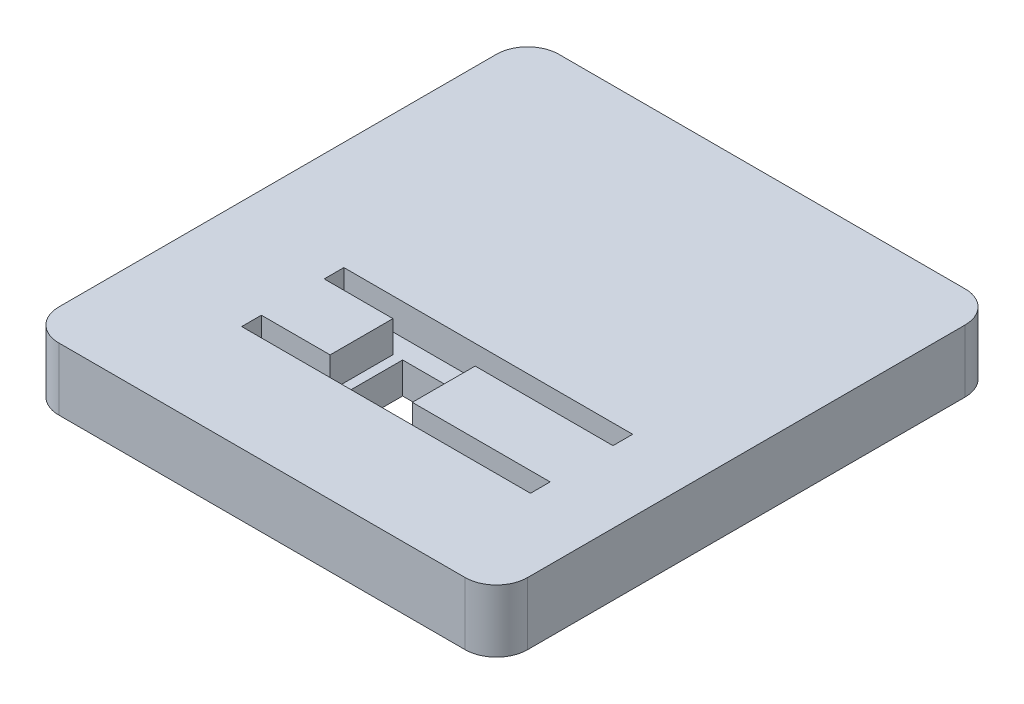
ISO-10303-21;
HEADER;
FILE_DESCRIPTION(('STEP AP214'),'2;1');
FILE_NAME('part.step','',(''),(''),'','','');
FILE_SCHEMA(('AUTOMOTIVE_DESIGN { 1 0 10303 214 1 1 1 1 }'));
ENDSEC;
DATA;
#1=APPLICATION_CONTEXT('core data for automotive mechanical design processes');
#2=APPLICATION_PROTOCOL_DEFINITION('international standard','automotive_design',2000,#1);
#3=PRODUCT_CONTEXT('',#1,'mechanical');
#4=PRODUCT('Part','Part','',(#3));
#5=PRODUCT_RELATED_PRODUCT_CATEGORY('part','',(#4));
#6=PRODUCT_DEFINITION_FORMATION('','',#4);
#7=PRODUCT_DEFINITION_CONTEXT('part definition',#1,'design');
#8=PRODUCT_DEFINITION('design','',#6,#7);
#9=PRODUCT_DEFINITION_SHAPE('','',#8);
#10=(LENGTH_UNIT() NAMED_UNIT(*) SI_UNIT(.MILLI.,.METRE.));
#11=(NAMED_UNIT(*) PLANE_ANGLE_UNIT() SI_UNIT($,.RADIAN.));
#12=(NAMED_UNIT(*) SI_UNIT($,.STERADIAN.) SOLID_ANGLE_UNIT());
#13=UNCERTAINTY_MEASURE_WITH_UNIT(LENGTH_MEASURE(1.E-05),#10,'distance_accuracy_value','');
#14=(GEOMETRIC_REPRESENTATION_CONTEXT(3) GLOBAL_UNCERTAINTY_ASSIGNED_CONTEXT((#13)) GLOBAL_UNIT_ASSIGNED_CONTEXT((#10,
#11,#12)) REPRESENTATION_CONTEXT('',''));
#15=CARTESIAN_POINT('',(0.,0.,0.));
#16=DIRECTION('',(0.,0.,1.));
#17=DIRECTION('',(1.,0.,0.));
#18=AXIS2_PLACEMENT_3D('',#15,#16,#17);
#19=CARTESIAN_POINT('',(2.5,-5.,-0.150000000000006));
#20=DIRECTION('',(1.,0.,0.));
#21=DIRECTION('',(0.,0.,-1.));
#22=AXIS2_PLACEMENT_3D('',#19,#20,#21);
#23=PLANE('',#22);
#24=DIRECTION('',(0.,0.,-1.));
#25=VECTOR('',#24,1.);
#26=CARTESIAN_POINT('',(2.5,5.,-0.150000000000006));
#27=LINE('',#26,#25);
#28=CARTESIAN_POINT('',(2.5,5.,9.99999999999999));
#29=VERTEX_POINT('',#28);
#30=CARTESIAN_POINT('',(2.5,5.,-0.150000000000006));
#31=VERTEX_POINT('',#30);
#32=EDGE_CURVE('E196',#29,#31,#27,.T.);
#33=ORIENTED_EDGE('',*,*,#32,.T.);
#34=DIRECTION('',(0.,1.,0.));
#35=VECTOR('',#34,1.);
#36=CARTESIAN_POINT('',(2.5,-5.,-0.150000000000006));
#37=LINE('',#36,#35);
#38=CARTESIAN_POINT('',(2.5,0.,-0.150000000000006));
#39=VERTEX_POINT('',#38);
#40=EDGE_CURVE('E218',#39,#31,#37,.T.);
#41=ORIENTED_EDGE('',*,*,#40,.F.);
#42=DIRECTION('',(0.,0.,-1.));
#43=VECTOR('',#42,1.);
#44=CARTESIAN_POINT('',(2.5,0.,0.));
#45=LINE('',#44,#43);
#46=CARTESIAN_POINT('',(2.5,0.,9.99999999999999));
#47=VERTEX_POINT('',#46);
#48=EDGE_CURVE('E254',#47,#39,#45,.T.);
#49=ORIENTED_EDGE('',*,*,#48,.F.);
#50=DIRECTION('',(0.,1.,0.));
#51=VECTOR('',#50,1.);
#52=CARTESIAN_POINT('',(2.5,-5.,9.99999999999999));
#53=LINE('',#52,#51);
#54=EDGE_CURVE('E214',#47,#29,#53,.T.);
#55=ORIENTED_EDGE('',*,*,#54,.T.);
#56=EDGE_LOOP('',(#33,#41,#49,#55));
#57=FACE_BOUND('',#56,.T.);
#58=ADVANCED_FACE('F32',(#57),#23,.F.);
#59=CARTESIAN_POINT('',(-7.65,-5.,9.99999999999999));
#60=DIRECTION('',(0.,0.,1.));
#61=DIRECTION('',(1.,0.,0.));
#62=AXIS2_PLACEMENT_3D('',#59,#60,#61);
#63=PLANE('',#62);
#64=DIRECTION('',(1.,0.,0.));
#65=VECTOR('',#64,1.);
#66=CARTESIAN_POINT('',(-7.65,5.,9.99999999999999));
#67=LINE('',#66,#65);
#68=CARTESIAN_POINT('',(-7.65,5.,9.99999999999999));
#69=VERTEX_POINT('',#68);
#70=EDGE_CURVE('E192',#69,#29,#67,.T.);
#71=ORIENTED_EDGE('',*,*,#70,.T.);
#72=ORIENTED_EDGE('',*,*,#54,.F.);
#73=DIRECTION('',(1.,0.,0.));
#74=VECTOR('',#73,1.);
#75=CARTESIAN_POINT('',(0.,0.,9.99999999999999));
#76=LINE('',#75,#74);
#77=CARTESIAN_POINT('',(-7.65,0.,9.99999999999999));
#78=VERTEX_POINT('',#77);
#79=EDGE_CURVE('E213',#78,#47,#76,.T.);
#80=ORIENTED_EDGE('',*,*,#79,.F.);
#81=DIRECTION('',(0.,1.,0.));
#82=VECTOR('',#81,1.);
#83=CARTESIAN_POINT('',(-7.65,-5.,9.99999999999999));
#84=LINE('',#83,#82);
#85=EDGE_CURVE('E207',#78,#69,#84,.T.);
#86=ORIENTED_EDGE('',*,*,#85,.T.);
#87=EDGE_LOOP('',(#71,#72,#80,#86));
#88=FACE_BOUND('',#87,.T.);
#89=ADVANCED_FACE('F211',(#88),#63,.F.);
#90=CARTESIAN_POINT('',(-7.65000000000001,-5.,-0.150000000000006));
#91=DIRECTION('',(-1.,0.,0.));
#92=DIRECTION('',(0.,0.,1.));
#93=AXIS2_PLACEMENT_3D('',#90,#91,#92);
#94=PLANE('',#93);
#95=DIRECTION('',(0.,0.,1.));
#96=VECTOR('',#95,1.);
#97=CARTESIAN_POINT('',(-7.65,5.,-0.150000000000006));
#98=LINE('',#97,#96);
#99=CARTESIAN_POINT('',(-7.65000000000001,5.,-0.150000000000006));
#100=VERTEX_POINT('',#99);
#101=EDGE_CURVE('E55',#100,#69,#98,.T.);
#102=ORIENTED_EDGE('',*,*,#101,.T.);
#103=ORIENTED_EDGE('',*,*,#85,.F.);
#104=DIRECTION('',(0.,0.,1.));
#105=VECTOR('',#104,1.);
#106=CARTESIAN_POINT('',(-7.65000000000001,0.,0.));
#107=LINE('',#106,#105);
#108=CARTESIAN_POINT('',(-7.65000000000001,0.,-0.150000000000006));
#109=VERTEX_POINT('',#108);
#110=EDGE_CURVE('E251',#109,#78,#107,.T.);
#111=ORIENTED_EDGE('',*,*,#110,.F.);
#112=DIRECTION('',(0.,1.,0.));
#113=VECTOR('',#112,1.);
#114=CARTESIAN_POINT('',(-7.65000000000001,-5.,-0.150000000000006));
#115=LINE('',#114,#113);
#116=EDGE_CURVE('E209',#109,#100,#115,.T.);
#117=ORIENTED_EDGE('',*,*,#116,.T.);
#118=EDGE_LOOP('',(#102,#103,#111,#117));
#119=FACE_BOUND('',#118,.T.);
#120=ADVANCED_FACE('F205',(#119),#94,.F.);
#121=CARTESIAN_POINT('',(-7.65000000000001,-5.,-0.150000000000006));
#122=DIRECTION('',(0.,0.,-1.));
#123=DIRECTION('',(-1.,0.,0.));
#124=AXIS2_PLACEMENT_3D('',#121,#122,#123);
#125=PLANE('',#124);
#126=DIRECTION('',(-1.,0.,0.));
#127=VECTOR('',#126,1.);
#128=CARTESIAN_POINT('',(-7.65,5.,-0.150000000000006));
#129=LINE('',#128,#127);
#130=EDGE_CURVE('E549',#31,#100,#129,.T.);
#131=ORIENTED_EDGE('',*,*,#130,.T.);
#132=ORIENTED_EDGE('',*,*,#116,.F.);
#133=DIRECTION('',(-1.,0.,0.));
#134=VECTOR('',#133,1.);
#135=CARTESIAN_POINT('',(0.,0.,-0.150000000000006));
#136=LINE('',#135,#134);
#137=EDGE_CURVE('E238',#39,#109,#136,.T.);
#138=ORIENTED_EDGE('',*,*,#137,.F.);
#139=ORIENTED_EDGE('',*,*,#40,.T.);
#140=EDGE_LOOP('',(#131,#132,#138,#139));
#141=FACE_BOUND('',#140,.T.);
#142=ADVANCED_FACE('F342',(#141),#125,.F.);
#143=CARTESIAN_POINT('',(37.5,10.,-50.));
#144=DIRECTION('',(-1.,0.,0.));
#145=DIRECTION('',(0.,0.,1.));
#146=AXIS2_PLACEMENT_3D('',#143,#144,#145);
#147=PLANE('',#146);
#148=DIRECTION('',(0.,0.,-1.));
#149=VECTOR('',#148,1.);
#150=CARTESIAN_POINT('',(37.5,10.,-50.));
#151=LINE('',#150,#149);
#152=CARTESIAN_POINT('',(37.5,10.,25.));
#153=VERTEX_POINT('',#152);
#154=CARTESIAN_POINT('',(37.5,10.,-45.));
#155=VERTEX_POINT('',#154);
#156=EDGE_CURVE('E225',#153,#155,#151,.T.);
#157=ORIENTED_EDGE('',*,*,#156,.F.);
#158=DIRECTION('',(0.,-1.,0.));
#159=VECTOR('',#158,1.);
#160=CARTESIAN_POINT('',(37.5,10.,25.));
#161=LINE('',#160,#159);
#162=CARTESIAN_POINT('',(37.5,0.,25.));
#163=VERTEX_POINT('',#162);
#164=EDGE_CURVE('E259',#153,#163,#161,.T.);
#165=ORIENTED_EDGE('',*,*,#164,.T.);
#166=DIRECTION('',(0.,0.,-1.));
#167=VECTOR('',#166,1.);
#168=CARTESIAN_POINT('',(37.5,0.,-50.));
#169=LINE('',#168,#167);
#170=CARTESIAN_POINT('',(37.5,0.,-45.));
#171=VERTEX_POINT('',#170);
#172=EDGE_CURVE('E216',#163,#171,#169,.T.);
#173=ORIENTED_EDGE('',*,*,#172,.T.);
#174=DIRECTION('',(0.,-1.,0.));
#175=VECTOR('',#174,1.);
#176=CARTESIAN_POINT('',(37.5,10.,-45.));
#177=LINE('',#176,#175);
#178=EDGE_CURVE('E257',#171,#155,#177,.F.);
#179=ORIENTED_EDGE('',*,*,#178,.T.);
#180=EDGE_LOOP('',(#157,#165,#173,#179));
#181=FACE_BOUND('',#180,.T.);
#182=ADVANCED_FACE('F322',(#181),#147,.F.);
#183=CARTESIAN_POINT('',(-37.5,10.,-50.));
#184=DIRECTION('',(0.,0.,1.));
#185=DIRECTION('',(1.,0.,0.));
#186=AXIS2_PLACEMENT_3D('',#183,#184,#185);
#187=PLANE('',#186);
#188=DIRECTION('',(-1.,0.,0.));
#189=VECTOR('',#188,1.);
#190=CARTESIAN_POINT('',(-37.5,10.,-50.));
#191=LINE('',#190,#189);
#192=CARTESIAN_POINT('',(32.5,10.,-50.));
#193=VERTEX_POINT('',#192);
#194=CARTESIAN_POINT('',(-32.5,10.,-50.));
#195=VERTEX_POINT('',#194);
#196=EDGE_CURVE('E228',#193,#195,#191,.T.);
#197=ORIENTED_EDGE('',*,*,#196,.F.);
#198=DIRECTION('',(0.,-1.,0.));
#199=VECTOR('',#198,1.);
#200=CARTESIAN_POINT('',(32.5,10.,-50.));
#201=LINE('',#200,#199);
#202=CARTESIAN_POINT('',(32.5,0.,-50.));
#203=VERTEX_POINT('',#202);
#204=EDGE_CURVE('E11',#193,#203,#201,.T.);
#205=ORIENTED_EDGE('',*,*,#204,.T.);
#206=DIRECTION('',(-1.,0.,0.));
#207=VECTOR('',#206,1.);
#208=CARTESIAN_POINT('',(-37.5,0.,-50.));
#209=LINE('',#208,#207);
#210=CARTESIAN_POINT('',(-32.5,0.,-50.));
#211=VERTEX_POINT('',#210);
#212=EDGE_CURVE('E241',#203,#211,#209,.T.);
#213=ORIENTED_EDGE('',*,*,#212,.T.);
#214=DIRECTION('',(0.,-1.,0.));
#215=VECTOR('',#214,1.);
#216=CARTESIAN_POINT('',(-32.5,10.,-50.));
#217=LINE('',#216,#215);
#218=EDGE_CURVE('E40',#211,#195,#217,.F.);
#219=ORIENTED_EDGE('',*,*,#218,.T.);
#220=EDGE_LOOP('',(#197,#205,#213,#219));
#221=FACE_BOUND('',#220,.T.);
#222=ADVANCED_FACE('F290',(#221),#187,.F.);
#223=CARTESIAN_POINT('',(-37.5,10.,-50.));
#224=DIRECTION('',(1.,0.,0.));
#225=DIRECTION('',(0.,0.,-1.));
#226=AXIS2_PLACEMENT_3D('',#223,#224,#225);
#227=PLANE('',#226);
#228=DIRECTION('',(0.,0.,1.));
#229=VECTOR('',#228,1.);
#230=CARTESIAN_POINT('',(-37.5,0.,-50.));
#231=LINE('',#230,#229);
#232=CARTESIAN_POINT('',(-37.5,0.,-45.));
#233=VERTEX_POINT('',#232);
#234=CARTESIAN_POINT('',(-37.5,0.,25.));
#235=VERTEX_POINT('',#234);
#236=EDGE_CURVE('E244',#233,#235,#231,.T.);
#237=ORIENTED_EDGE('',*,*,#236,.T.);
#238=DIRECTION('',(0.,-1.,0.));
#239=VECTOR('',#238,1.);
#240=CARTESIAN_POINT('',(-37.5,10.,25.));
#241=LINE('',#240,#239);
#242=CARTESIAN_POINT('',(-37.5,10.,25.));
#243=VERTEX_POINT('',#242);
#244=EDGE_CURVE('E286',#235,#243,#241,.F.);
#245=ORIENTED_EDGE('',*,*,#244,.T.);
#246=DIRECTION('',(0.,0.,1.));
#247=VECTOR('',#246,1.);
#248=CARTESIAN_POINT('',(-37.5,10.,-50.));
#249=LINE('',#248,#247);
#250=CARTESIAN_POINT('',(-37.5,10.,-45.));
#251=VERTEX_POINT('',#250);
#252=EDGE_CURVE('E232',#251,#243,#249,.T.);
#253=ORIENTED_EDGE('',*,*,#252,.F.);
#254=DIRECTION('',(0.,-1.,0.));
#255=VECTOR('',#254,1.);
#256=CARTESIAN_POINT('',(-37.5,10.,-45.));
#257=LINE('',#256,#255);
#258=EDGE_CURVE('E283',#251,#233,#257,.T.);
#259=ORIENTED_EDGE('',*,*,#258,.T.);
#260=EDGE_LOOP('',(#237,#245,#253,#259));
#261=FACE_BOUND('',#260,.T.);
#262=ADVANCED_FACE('F302',(#261),#227,.F.);
#263=CARTESIAN_POINT('',(-37.5,10.,30.));
#264=DIRECTION('',(0.,0.,-1.));
#265=DIRECTION('',(-1.,0.,0.));
#266=AXIS2_PLACEMENT_3D('',#263,#264,#265);
#267=PLANE('',#266);
#268=DIRECTION('',(1.,0.,0.));
#269=VECTOR('',#268,1.);
#270=CARTESIAN_POINT('',(-37.5,0.,30.));
#271=LINE('',#270,#269);
#272=CARTESIAN_POINT('',(-32.5,0.,30.));
#273=VERTEX_POINT('',#272);
#274=CARTESIAN_POINT('',(32.5,0.,30.));
#275=VERTEX_POINT('',#274);
#276=EDGE_CURVE('E229',#273,#275,#271,.T.);
#277=ORIENTED_EDGE('',*,*,#276,.T.);
#278=DIRECTION('',(0.,-1.,0.));
#279=VECTOR('',#278,1.);
#280=CARTESIAN_POINT('',(32.5,10.,30.));
#281=LINE('',#280,#279);
#282=CARTESIAN_POINT('',(32.5,10.,30.));
#283=VERTEX_POINT('',#282);
#284=EDGE_CURVE('E273',#275,#283,#281,.F.);
#285=ORIENTED_EDGE('',*,*,#284,.T.);
#286=DIRECTION('',(1.,0.,0.));
#287=VECTOR('',#286,1.);
#288=CARTESIAN_POINT('',(-37.5,10.,30.));
#289=LINE('',#288,#287);
#290=CARTESIAN_POINT('',(-32.5,10.,30.));
#291=VERTEX_POINT('',#290);
#292=EDGE_CURVE('E235',#291,#283,#289,.T.);
#293=ORIENTED_EDGE('',*,*,#292,.F.);
#294=DIRECTION('',(0.,-1.,0.));
#295=VECTOR('',#294,1.);
#296=CARTESIAN_POINT('',(-32.5,10.,30.));
#297=LINE('',#296,#295);
#298=EDGE_CURVE('E270',#291,#273,#297,.T.);
#299=ORIENTED_EDGE('',*,*,#298,.T.);
#300=EDGE_LOOP('',(#277,#285,#293,#299));
#301=FACE_BOUND('',#300,.T.);
#302=ADVANCED_FACE('F314',(#301),#267,.F.);
#303=CARTESIAN_POINT('',(0.,10.,0.));
#304=DIRECTION('',(0.,1.,0.));
#305=DIRECTION('',(0.,0.,1.));
#306=AXIS2_PLACEMENT_3D('',#303,#304,#305);
#307=PLANE('',#306);
#308=DIRECTION('',(-1.,0.,0.));
#309=VECTOR('',#308,1.);
#310=CARTESIAN_POINT('',(-9.15,10.,-3.25250000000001));
#311=LINE('',#310,#309);
#312=CARTESIAN_POINT('',(26.0534834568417,10.,-3.25250000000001));
#313=VERTEX_POINT('',#312);
#314=CARTESIAN_POINT('',(-20.15,10.,-3.25250000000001));
#315=VERTEX_POINT('',#314);
#316=EDGE_CURVE('E584',#313,#315,#311,.T.);
#317=ORIENTED_EDGE('',*,*,#316,.F.);
#318=DIRECTION('',(0.,0.,-1.));
#319=VECTOR('',#318,1.);
#320=CARTESIAN_POINT('',(26.0534834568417,10.,-3.25250000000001));
#321=LINE('',#320,#319);
#322=CARTESIAN_POINT('',(26.0534834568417,10.,-0.102500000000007));
#323=VERTEX_POINT('',#322);
#324=EDGE_CURVE('E581',#323,#313,#321,.T.);
#325=ORIENTED_EDGE('',*,*,#324,.F.);
#326=DIRECTION('',(1.,0.,0.));
#327=VECTOR('',#326,1.);
#328=CARTESIAN_POINT('',(26.0534834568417,10.,-0.102500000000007));
#329=LINE('',#328,#327);
#330=CARTESIAN_POINT('',(4.,10.,-0.102500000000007));
#331=VERTEX_POINT('',#330);
#332=EDGE_CURVE('E578',#331,#323,#329,.T.);
#333=ORIENTED_EDGE('',*,*,#332,.F.);
#334=DIRECTION('',(0.,0.,-1.));
#335=VECTOR('',#334,1.);
#336=CARTESIAN_POINT('',(4.,10.,-0.102500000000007));
#337=LINE('',#336,#335);
#338=CARTESIAN_POINT('',(4.,10.,9.94749999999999));
#339=VERTEX_POINT('',#338);
#340=EDGE_CURVE('E575',#339,#331,#337,.T.);
#341=ORIENTED_EDGE('',*,*,#340,.F.);
#342=DIRECTION('',(-1.,0.,0.));
#343=VECTOR('',#342,1.);
#344=CARTESIAN_POINT('',(4.,10.,9.94749999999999));
#345=LINE('',#344,#343);
#346=CARTESIAN_POINT('',(26.0534834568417,10.,9.94749999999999));
#347=VERTEX_POINT('',#346);
#348=EDGE_CURVE('E572',#347,#339,#345,.T.);
#349=ORIENTED_EDGE('',*,*,#348,.F.);
#350=DIRECTION('',(0.,0.,-1.));
#351=VECTOR('',#350,1.);
#352=CARTESIAN_POINT('',(26.0534834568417,10.,9.94749999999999));
#353=LINE('',#352,#351);
#354=CARTESIAN_POINT('',(26.0534834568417,10.,13.0975));
#355=VERTEX_POINT('',#354);
#356=EDGE_CURVE('E569',#355,#347,#353,.T.);
#357=ORIENTED_EDGE('',*,*,#356,.F.);
#358=DIRECTION('',(1.,0.,0.));
#359=VECTOR('',#358,1.);
#360=CARTESIAN_POINT('',(26.0534834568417,10.,13.0975));
#361=LINE('',#360,#359);
#362=CARTESIAN_POINT('',(-20.15,10.,13.0975));
#363=VERTEX_POINT('',#362);
#364=EDGE_CURVE('E566',#363,#355,#361,.T.);
#365=ORIENTED_EDGE('',*,*,#364,.F.);
#366=DIRECTION('',(0.,0.,1.));
#367=VECTOR('',#366,1.);
#368=CARTESIAN_POINT('',(-20.15,10.,9.9475));
#369=LINE('',#368,#367);
#370=CARTESIAN_POINT('',(-20.15,10.,9.9475));
#371=VERTEX_POINT('',#370);
#372=EDGE_CURVE('E563',#371,#363,#369,.T.);
#373=ORIENTED_EDGE('',*,*,#372,.F.);
#374=DIRECTION('',(-1.,0.,0.));
#375=VECTOR('',#374,1.);
#376=CARTESIAN_POINT('',(-9.15,10.,9.9475));
#377=LINE('',#376,#375);
#378=CARTESIAN_POINT('',(-9.15,10.,9.9475));
#379=VERTEX_POINT('',#378);
#380=EDGE_CURVE('E557',#379,#371,#377,.T.);
#381=ORIENTED_EDGE('',*,*,#380,.F.);
#382=DIRECTION('',(0.,0.,1.));
#383=VECTOR('',#382,1.);
#384=CARTESIAN_POINT('',(-9.15,10.,9.9475));
#385=LINE('',#384,#383);
#386=CARTESIAN_POINT('',(-9.15,10.,-0.102500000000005));
#387=VERTEX_POINT('',#386);
#388=EDGE_CURVE('E555',#387,#379,#385,.T.);
#389=ORIENTED_EDGE('',*,*,#388,.F.);
#390=DIRECTION('',(1.,0.,0.));
#391=VECTOR('',#390,1.);
#392=CARTESIAN_POINT('',(-20.15,10.,-0.102500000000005));
#393=LINE('',#392,#391);
#394=CARTESIAN_POINT('',(-20.15,10.,-0.102500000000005));
#395=VERTEX_POINT('',#394);
#396=EDGE_CURVE('E548',#395,#387,#393,.T.);
#397=ORIENTED_EDGE('',*,*,#396,.F.);
#398=DIRECTION('',(0.,0.,1.));
#399=VECTOR('',#398,1.);
#400=CARTESIAN_POINT('',(-20.15,10.,-3.25250000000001));
#401=LINE('',#400,#399);
#402=EDGE_CURVE('E543',#315,#395,#401,.T.);
#403=ORIENTED_EDGE('',*,*,#402,.F.);
#404=EDGE_LOOP('',(#317,#325,#333,#341,#349,#357,#365,#373,#381,#389,#397,#403));
#405=FACE_BOUND('',#404,.T.);
#406=ORIENTED_EDGE('',*,*,#292,.T.);
#407=CARTESIAN_POINT('',(32.5,10.,25.));
#408=DIRECTION('',(0.,1.,0.));
#409=DIRECTION('',(0.,0.,1.));
#410=AXIS2_PLACEMENT_3D('',#407,#408,#409);
#411=CIRCLE('',#410,5.);
#412=EDGE_CURVE('E281',#283,#153,#411,.T.);
#413=ORIENTED_EDGE('',*,*,#412,.T.);
#414=ORIENTED_EDGE('',*,*,#156,.T.);
#415=CARTESIAN_POINT('',(32.5,10.,-45.));
#416=DIRECTION('',(0.,1.,0.));
#417=DIRECTION('',(0.,0.,1.));
#418=AXIS2_PLACEMENT_3D('',#415,#416,#417);
#419=CIRCLE('',#418,5.);
#420=EDGE_CURVE('E277',#155,#193,#419,.T.);
#421=ORIENTED_EDGE('',*,*,#420,.T.);
#422=ORIENTED_EDGE('',*,*,#196,.T.);
#423=CARTESIAN_POINT('',(-32.5,10.,-45.));
#424=DIRECTION('',(0.,1.,0.));
#425=DIRECTION('',(0.,0.,1.));
#426=AXIS2_PLACEMENT_3D('',#423,#424,#425);
#427=CIRCLE('',#426,5.);
#428=EDGE_CURVE('E275',#195,#251,#427,.T.);
#429=ORIENTED_EDGE('',*,*,#428,.T.);
#430=ORIENTED_EDGE('',*,*,#252,.T.);
#431=CARTESIAN_POINT('',(-32.5,10.,25.));
#432=DIRECTION('',(0.,1.,0.));
#433=DIRECTION('',(0.,0.,1.));
#434=AXIS2_PLACEMENT_3D('',#431,#432,#433);
#435=CIRCLE('',#434,5.);
#436=EDGE_CURVE('E279',#243,#291,#435,.T.);
#437=ORIENTED_EDGE('',*,*,#436,.T.);
#438=EDGE_LOOP('',(#406,#413,#414,#421,#422,#429,#430,#437));
#439=FACE_BOUND('',#438,.T.);
#440=ADVANCED_FACE('F296',(#405,#439),#307,.T.);
#441=CARTESIAN_POINT('',(0.,0.,0.));
#442=DIRECTION('',(0.,1.,0.));
#443=DIRECTION('',(0.,0.,1.));
#444=AXIS2_PLACEMENT_3D('',#441,#442,#443);
#445=PLANE('',#444);
#446=ORIENTED_EDGE('',*,*,#79,.T.);
#447=ORIENTED_EDGE('',*,*,#48,.T.);
#448=ORIENTED_EDGE('',*,*,#137,.T.);
#449=ORIENTED_EDGE('',*,*,#110,.T.);
#450=EDGE_LOOP('',(#446,#447,#448,#449));
#451=FACE_BOUND('',#450,.T.);
#452=ORIENTED_EDGE('',*,*,#172,.F.);
#453=CARTESIAN_POINT('',(32.5,0.,25.));
#454=DIRECTION('',(0.,1.,0.));
#455=DIRECTION('',(0.,0.,1.));
#456=AXIS2_PLACEMENT_3D('',#453,#454,#455);
#457=CIRCLE('',#456,5.);
#458=EDGE_CURVE('E268',#163,#275,#457,.F.);
#459=ORIENTED_EDGE('',*,*,#458,.T.);
#460=ORIENTED_EDGE('',*,*,#276,.F.);
#461=CARTESIAN_POINT('',(-32.5,0.,25.));
#462=DIRECTION('',(0.,1.,0.));
#463=DIRECTION('',(0.,0.,1.));
#464=AXIS2_PLACEMENT_3D('',#461,#462,#463);
#465=CIRCLE('',#464,5.);
#466=EDGE_CURVE('E266',#273,#235,#465,.F.);
#467=ORIENTED_EDGE('',*,*,#466,.T.);
#468=ORIENTED_EDGE('',*,*,#236,.F.);
#469=CARTESIAN_POINT('',(-32.5,0.,-45.));
#470=DIRECTION('',(0.,1.,0.));
#471=DIRECTION('',(0.,0.,1.));
#472=AXIS2_PLACEMENT_3D('',#469,#470,#471);
#473=CIRCLE('',#472,5.);
#474=EDGE_CURVE('E262',#233,#211,#473,.F.);
#475=ORIENTED_EDGE('',*,*,#474,.T.);
#476=ORIENTED_EDGE('',*,*,#212,.F.);
#477=CARTESIAN_POINT('',(32.5,0.,-45.));
#478=DIRECTION('',(0.,1.,0.));
#479=DIRECTION('',(0.,0.,1.));
#480=AXIS2_PLACEMENT_3D('',#477,#478,#479);
#481=CIRCLE('',#480,5.);
#482=EDGE_CURVE('E264',#203,#171,#481,.F.);
#483=ORIENTED_EDGE('',*,*,#482,.T.);
#484=EDGE_LOOP('',(#452,#459,#460,#467,#468,#475,#476,#483));
#485=FACE_BOUND('',#484,.T.);
#486=ADVANCED_FACE('F306',(#451,#485),#445,.F.);
#487=CARTESIAN_POINT('',(32.5,10.,25.));
#488=DIRECTION('',(0.,-1.,0.));
#489=DIRECTION('',(0.,0.,-1.));
#490=AXIS2_PLACEMENT_3D('',#487,#488,#489);
#491=CYLINDRICAL_SURFACE('',#490,5.);
#492=ORIENTED_EDGE('',*,*,#412,.F.);
#493=ORIENTED_EDGE('',*,*,#284,.F.);
#494=ORIENTED_EDGE('',*,*,#458,.F.);
#495=ORIENTED_EDGE('',*,*,#164,.F.);
#496=EDGE_LOOP('',(#492,#493,#494,#495));
#497=FACE_BOUND('',#496,.T.);
#498=ADVANCED_FACE('F320',(#497),#491,.T.);
#499=CARTESIAN_POINT('',(-32.5,10.,25.));
#500=DIRECTION('',(0.,-1.,0.));
#501=DIRECTION('',(0.,0.,-1.));
#502=AXIS2_PLACEMENT_3D('',#499,#500,#501);
#503=CYLINDRICAL_SURFACE('',#502,5.);
#504=ORIENTED_EDGE('',*,*,#436,.F.);
#505=ORIENTED_EDGE('',*,*,#244,.F.);
#506=ORIENTED_EDGE('',*,*,#466,.F.);
#507=ORIENTED_EDGE('',*,*,#298,.F.);
#508=EDGE_LOOP('',(#504,#505,#506,#507));
#509=FACE_BOUND('',#508,.T.);
#510=ADVANCED_FACE('F311',(#509),#503,.T.);
#511=CARTESIAN_POINT('',(32.5,10.,-45.));
#512=DIRECTION('',(0.,-1.,0.));
#513=DIRECTION('',(0.,0.,-1.));
#514=AXIS2_PLACEMENT_3D('',#511,#512,#513);
#515=CYLINDRICAL_SURFACE('',#514,5.);
#516=ORIENTED_EDGE('',*,*,#420,.F.);
#517=ORIENTED_EDGE('',*,*,#178,.F.);
#518=ORIENTED_EDGE('',*,*,#482,.F.);
#519=ORIENTED_EDGE('',*,*,#204,.F.);
#520=EDGE_LOOP('',(#516,#517,#518,#519));
#521=FACE_BOUND('',#520,.T.);
#522=ADVANCED_FACE('F325',(#521),#515,.T.);
#523=CARTESIAN_POINT('',(-32.5,10.,-45.));
#524=DIRECTION('',(0.,-1.,0.));
#525=DIRECTION('',(0.,0.,-1.));
#526=AXIS2_PLACEMENT_3D('',#523,#524,#525);
#527=CYLINDRICAL_SURFACE('',#526,5.);
#528=ORIENTED_EDGE('',*,*,#428,.F.);
#529=ORIENTED_EDGE('',*,*,#218,.F.);
#530=ORIENTED_EDGE('',*,*,#474,.F.);
#531=ORIENTED_EDGE('',*,*,#258,.F.);
#532=EDGE_LOOP('',(#528,#529,#530,#531));
#533=FACE_BOUND('',#532,.T.);
#534=ADVANCED_FACE('F34',(#533),#527,.T.);
#535=CARTESIAN_POINT('',(-9.15,5.,-3.25250000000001));
#536=DIRECTION('',(0.,0.,-1.));
#537=DIRECTION('',(-1.,0.,0.));
#538=AXIS2_PLACEMENT_3D('',#535,#536,#537);
#539=PLANE('',#538);
#540=ORIENTED_EDGE('',*,*,#316,.T.);
#541=DIRECTION('',(0.,1.,0.));
#542=VECTOR('',#541,1.);
#543=CARTESIAN_POINT('',(-20.15,5.,-3.25250000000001));
#544=LINE('',#543,#542);
#545=CARTESIAN_POINT('',(-20.15,5.,-3.25250000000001));
#546=VERTEX_POINT('',#545);
#547=EDGE_CURVE('E47',#546,#315,#544,.T.);
#548=ORIENTED_EDGE('',*,*,#547,.F.);
#549=DIRECTION('',(-1.,0.,0.));
#550=VECTOR('',#549,1.);
#551=CARTESIAN_POINT('',(-9.15,5.,-3.25250000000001));
#552=LINE('',#551,#550);
#553=CARTESIAN_POINT('',(26.0534834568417,5.,-3.25250000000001));
#554=VERTEX_POINT('',#553);
#555=EDGE_CURVE('E586',#554,#546,#552,.T.);
#556=ORIENTED_EDGE('',*,*,#555,.F.);
#557=DIRECTION('',(0.,1.,0.));
#558=VECTOR('',#557,1.);
#559=CARTESIAN_POINT('',(26.0534834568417,5.,-3.25250000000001));
#560=LINE('',#559,#558);
#561=EDGE_CURVE('E224',#554,#313,#560,.T.);
#562=ORIENTED_EDGE('',*,*,#561,.T.);
#563=EDGE_LOOP('',(#540,#548,#556,#562));
#564=FACE_BOUND('',#563,.T.);
#565=ADVANCED_FACE('F331',(#564),#539,.F.);
#566=CARTESIAN_POINT('',(26.0534834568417,5.,-3.25250000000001));
#567=DIRECTION('',(1.,0.,0.));
#568=DIRECTION('',(0.,0.,-1.));
#569=AXIS2_PLACEMENT_3D('',#566,#567,#568);
#570=PLANE('',#569);
#571=ORIENTED_EDGE('',*,*,#324,.T.);
#572=ORIENTED_EDGE('',*,*,#561,.F.);
#573=DIRECTION('',(0.,0.,-1.));
#574=VECTOR('',#573,1.);
#575=CARTESIAN_POINT('',(26.0534834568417,5.,-3.25250000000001));
#576=LINE('',#575,#574);
#577=CARTESIAN_POINT('',(26.0534834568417,5.,-0.102500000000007));
#578=VERTEX_POINT('',#577);
#579=EDGE_CURVE('E606',#578,#554,#576,.T.);
#580=ORIENTED_EDGE('',*,*,#579,.F.);
#581=DIRECTION('',(0.,1.,0.));
#582=VECTOR('',#581,1.);
#583=CARTESIAN_POINT('',(26.0534834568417,5.,-0.102500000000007));
#584=LINE('',#583,#582);
#585=EDGE_CURVE('E588',#578,#323,#584,.T.);
#586=ORIENTED_EDGE('',*,*,#585,.T.);
#587=EDGE_LOOP('',(#571,#572,#580,#586));
#588=FACE_BOUND('',#587,.T.);
#589=ADVANCED_FACE('F420',(#588),#570,.F.);
#590=CARTESIAN_POINT('',(26.0534834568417,5.,-0.102500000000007));
#591=DIRECTION('',(0.,0.,1.));
#592=DIRECTION('',(1.,0.,0.));
#593=AXIS2_PLACEMENT_3D('',#590,#591,#592);
#594=PLANE('',#593);
#595=ORIENTED_EDGE('',*,*,#332,.T.);
#596=ORIENTED_EDGE('',*,*,#585,.F.);
#597=DIRECTION('',(1.,0.,0.));
#598=VECTOR('',#597,1.);
#599=CARTESIAN_POINT('',(26.0534834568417,5.,-0.102500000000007));
#600=LINE('',#599,#598);
#601=CARTESIAN_POINT('',(4.,5.,-0.102500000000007));
#602=VERTEX_POINT('',#601);
#603=EDGE_CURVE('E608',#602,#578,#600,.T.);
#604=ORIENTED_EDGE('',*,*,#603,.F.);
#605=DIRECTION('',(0.,1.,0.));
#606=VECTOR('',#605,1.);
#607=CARTESIAN_POINT('',(4.,5.,-0.102500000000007));
#608=LINE('',#607,#606);
#609=EDGE_CURVE('E590',#602,#331,#608,.T.);
#610=ORIENTED_EDGE('',*,*,#609,.T.);
#611=EDGE_LOOP('',(#595,#596,#604,#610));
#612=FACE_BOUND('',#611,.T.);
#613=ADVANCED_FACE('F430',(#612),#594,.F.);
#614=CARTESIAN_POINT('',(4.,5.,-0.102500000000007));
#615=DIRECTION('',(1.,0.,0.));
#616=DIRECTION('',(0.,0.,-1.));
#617=AXIS2_PLACEMENT_3D('',#614,#615,#616);
#618=PLANE('',#617);
#619=ORIENTED_EDGE('',*,*,#340,.T.);
#620=ORIENTED_EDGE('',*,*,#609,.F.);
#621=DIRECTION('',(0.,0.,-1.));
#622=VECTOR('',#621,1.);
#623=CARTESIAN_POINT('',(4.,5.,-0.102500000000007));
#624=LINE('',#623,#622);
#625=CARTESIAN_POINT('',(4.,5.,9.94749999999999));
#626=VERTEX_POINT('',#625);
#627=EDGE_CURVE('E612',#626,#602,#624,.T.);
#628=ORIENTED_EDGE('',*,*,#627,.F.);
#629=DIRECTION('',(0.,1.,0.));
#630=VECTOR('',#629,1.);
#631=CARTESIAN_POINT('',(4.,5.,9.94749999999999));
#632=LINE('',#631,#630);
#633=EDGE_CURVE('E592',#626,#339,#632,.T.);
#634=ORIENTED_EDGE('',*,*,#633,.T.);
#635=EDGE_LOOP('',(#619,#620,#628,#634));
#636=FACE_BOUND('',#635,.T.);
#637=ADVANCED_FACE('F440',(#636),#618,.F.);
#638=CARTESIAN_POINT('',(4.,5.,9.94749999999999));
#639=DIRECTION('',(0.,0.,-1.));
#640=DIRECTION('',(-1.,0.,0.));
#641=AXIS2_PLACEMENT_3D('',#638,#639,#640);
#642=PLANE('',#641);
#643=ORIENTED_EDGE('',*,*,#348,.T.);
#644=ORIENTED_EDGE('',*,*,#633,.F.);
#645=DIRECTION('',(-1.,0.,0.));
#646=VECTOR('',#645,1.);
#647=CARTESIAN_POINT('',(4.,5.,9.94749999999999));
#648=LINE('',#647,#646);
#649=CARTESIAN_POINT('',(26.0534834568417,5.,9.94749999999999));
#650=VERTEX_POINT('',#649);
#651=EDGE_CURVE('E617',#650,#626,#648,.T.);
#652=ORIENTED_EDGE('',*,*,#651,.F.);
#653=DIRECTION('',(0.,1.,0.));
#654=VECTOR('',#653,1.);
#655=CARTESIAN_POINT('',(26.0534834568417,5.,9.94749999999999));
#656=LINE('',#655,#654);
#657=EDGE_CURVE('E594',#650,#347,#656,.T.);
#658=ORIENTED_EDGE('',*,*,#657,.T.);
#659=EDGE_LOOP('',(#643,#644,#652,#658));
#660=FACE_BOUND('',#659,.T.);
#661=ADVANCED_FACE('F450',(#660),#642,.F.);
#662=CARTESIAN_POINT('',(26.0534834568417,5.,9.94749999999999));
#663=DIRECTION('',(1.,0.,0.));
#664=DIRECTION('',(0.,0.,-1.));
#665=AXIS2_PLACEMENT_3D('',#662,#663,#664);
#666=PLANE('',#665);
#667=ORIENTED_EDGE('',*,*,#356,.T.);
#668=ORIENTED_EDGE('',*,*,#657,.F.);
#669=DIRECTION('',(0.,0.,-1.));
#670=VECTOR('',#669,1.);
#671=CARTESIAN_POINT('',(26.0534834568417,5.,9.94749999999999));
#672=LINE('',#671,#670);
#673=CARTESIAN_POINT('',(26.0534834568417,5.,13.0975));
#674=VERTEX_POINT('',#673);
#675=EDGE_CURVE('E620',#674,#650,#672,.T.);
#676=ORIENTED_EDGE('',*,*,#675,.F.);
#677=DIRECTION('',(0.,1.,0.));
#678=VECTOR('',#677,1.);
#679=CARTESIAN_POINT('',(26.0534834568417,5.,13.0975));
#680=LINE('',#679,#678);
#681=EDGE_CURVE('E596',#674,#355,#680,.T.);
#682=ORIENTED_EDGE('',*,*,#681,.T.);
#683=EDGE_LOOP('',(#667,#668,#676,#682));
#684=FACE_BOUND('',#683,.T.);
#685=ADVANCED_FACE('F460',(#684),#666,.F.);
#686=CARTESIAN_POINT('',(26.0534834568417,5.,13.0975));
#687=DIRECTION('',(0.,0.,1.));
#688=DIRECTION('',(1.,0.,0.));
#689=AXIS2_PLACEMENT_3D('',#686,#687,#688);
#690=PLANE('',#689);
#691=ORIENTED_EDGE('',*,*,#364,.T.);
#692=ORIENTED_EDGE('',*,*,#681,.F.);
#693=DIRECTION('',(1.,0.,0.));
#694=VECTOR('',#693,1.);
#695=CARTESIAN_POINT('',(-20.15,5.,13.0975));
#696=LINE('',#695,#694);
#697=CARTESIAN_POINT('',(-20.15,5.,13.0975));
#698=VERTEX_POINT('',#697);
#699=EDGE_CURVE('E623',#698,#674,#696,.T.);
#700=ORIENTED_EDGE('',*,*,#699,.F.);
#701=DIRECTION('',(0.,1.,0.));
#702=VECTOR('',#701,1.);
#703=CARTESIAN_POINT('',(-20.15,5.,13.0975));
#704=LINE('',#703,#702);
#705=EDGE_CURVE('E598',#698,#363,#704,.T.);
#706=ORIENTED_EDGE('',*,*,#705,.T.);
#707=EDGE_LOOP('',(#691,#692,#700,#706));
#708=FACE_BOUND('',#707,.T.);
#709=ADVANCED_FACE('F470',(#708),#690,.F.);
#710=CARTESIAN_POINT('',(-20.15,5.,9.9475));
#711=DIRECTION('',(-1.,0.,0.));
#712=DIRECTION('',(0.,0.,1.));
#713=AXIS2_PLACEMENT_3D('',#710,#711,#712);
#714=PLANE('',#713);
#715=ORIENTED_EDGE('',*,*,#372,.T.);
#716=ORIENTED_EDGE('',*,*,#705,.F.);
#717=DIRECTION('',(0.,0.,1.));
#718=VECTOR('',#717,1.);
#719=CARTESIAN_POINT('',(-20.15,5.,9.9475));
#720=LINE('',#719,#718);
#721=CARTESIAN_POINT('',(-20.15,5.,9.9475));
#722=VERTEX_POINT('',#721);
#723=EDGE_CURVE('E625',#722,#698,#720,.T.);
#724=ORIENTED_EDGE('',*,*,#723,.F.);
#725=DIRECTION('',(0.,1.,0.));
#726=VECTOR('',#725,1.);
#727=CARTESIAN_POINT('',(-20.15,5.,9.9475));
#728=LINE('',#727,#726);
#729=EDGE_CURVE('E600',#722,#371,#728,.T.);
#730=ORIENTED_EDGE('',*,*,#729,.T.);
#731=EDGE_LOOP('',(#715,#716,#724,#730));
#732=FACE_BOUND('',#731,.T.);
#733=ADVANCED_FACE('F481',(#732),#714,.F.);
#734=CARTESIAN_POINT('',(-9.15,5.,9.9475));
#735=DIRECTION('',(0.,0.,-1.));
#736=DIRECTION('',(-1.,0.,0.));
#737=AXIS2_PLACEMENT_3D('',#734,#735,#736);
#738=PLANE('',#737);
#739=ORIENTED_EDGE('',*,*,#380,.T.);
#740=ORIENTED_EDGE('',*,*,#729,.F.);
#741=DIRECTION('',(-1.,0.,0.));
#742=VECTOR('',#741,1.);
#743=CARTESIAN_POINT('',(-9.15,5.,9.9475));
#744=LINE('',#743,#742);
#745=CARTESIAN_POINT('',(-9.15,5.,9.9475));
#746=VERTEX_POINT('',#745);
#747=EDGE_CURVE('E628',#746,#722,#744,.T.);
#748=ORIENTED_EDGE('',*,*,#747,.F.);
#749=DIRECTION('',(0.,1.,0.));
#750=VECTOR('',#749,1.);
#751=CARTESIAN_POINT('',(-9.15,5.,9.9475));
#752=LINE('',#751,#750);
#753=EDGE_CURVE('E602',#746,#379,#752,.T.);
#754=ORIENTED_EDGE('',*,*,#753,.T.);
#755=EDGE_LOOP('',(#739,#740,#748,#754));
#756=FACE_BOUND('',#755,.T.);
#757=ADVANCED_FACE('F491',(#756),#738,.F.);
#758=CARTESIAN_POINT('',(-9.15,5.,9.9475));
#759=DIRECTION('',(-1.,0.,0.));
#760=DIRECTION('',(0.,0.,1.));
#761=AXIS2_PLACEMENT_3D('',#758,#759,#760);
#762=PLANE('',#761);
#763=ORIENTED_EDGE('',*,*,#388,.T.);
#764=ORIENTED_EDGE('',*,*,#753,.F.);
#765=DIRECTION('',(0.,0.,1.));
#766=VECTOR('',#765,1.);
#767=CARTESIAN_POINT('',(-9.15,5.,9.9475));
#768=LINE('',#767,#766);
#769=CARTESIAN_POINT('',(-9.15,5.,-0.102500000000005));
#770=VERTEX_POINT('',#769);
#771=EDGE_CURVE('E631',#770,#746,#768,.T.);
#772=ORIENTED_EDGE('',*,*,#771,.F.);
#773=DIRECTION('',(0.,1.,0.));
#774=VECTOR('',#773,1.);
#775=CARTESIAN_POINT('',(-9.15,5.,-0.102500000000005));
#776=LINE('',#775,#774);
#777=EDGE_CURVE('E604',#770,#387,#776,.T.);
#778=ORIENTED_EDGE('',*,*,#777,.T.);
#779=EDGE_LOOP('',(#763,#764,#772,#778));
#780=FACE_BOUND('',#779,.T.);
#781=ADVANCED_FACE('F501',(#780),#762,.F.);
#782=CARTESIAN_POINT('',(-20.15,5.,-0.102500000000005));
#783=DIRECTION('',(0.,0.,1.));
#784=DIRECTION('',(1.,0.,0.));
#785=AXIS2_PLACEMENT_3D('',#782,#783,#784);
#786=PLANE('',#785);
#787=ORIENTED_EDGE('',*,*,#396,.T.);
#788=ORIENTED_EDGE('',*,*,#777,.F.);
#789=DIRECTION('',(1.,0.,0.));
#790=VECTOR('',#789,1.);
#791=CARTESIAN_POINT('',(-20.15,5.,-0.102500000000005));
#792=LINE('',#791,#790);
#793=CARTESIAN_POINT('',(-20.15,5.,-0.102500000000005));
#794=VERTEX_POINT('',#793);
#795=EDGE_CURVE('E634',#794,#770,#792,.T.);
#796=ORIENTED_EDGE('',*,*,#795,.F.);
#797=DIRECTION('',(0.,1.,0.));
#798=VECTOR('',#797,1.);
#799=CARTESIAN_POINT('',(-20.15,5.,-0.102500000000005));
#800=LINE('',#799,#798);
#801=EDGE_CURVE('E545',#794,#395,#800,.T.);
#802=ORIENTED_EDGE('',*,*,#801,.T.);
#803=EDGE_LOOP('',(#787,#788,#796,#802));
#804=FACE_BOUND('',#803,.T.);
#805=ADVANCED_FACE('F511',(#804),#786,.F.);
#806=CARTESIAN_POINT('',(-20.15,5.,-3.25250000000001));
#807=DIRECTION('',(-1.,0.,0.));
#808=DIRECTION('',(0.,0.,1.));
#809=AXIS2_PLACEMENT_3D('',#806,#807,#808);
#810=PLANE('',#809);
#811=ORIENTED_EDGE('',*,*,#402,.T.);
#812=ORIENTED_EDGE('',*,*,#801,.F.);
#813=DIRECTION('',(0.,0.,1.));
#814=VECTOR('',#813,1.);
#815=CARTESIAN_POINT('',(-20.15,5.,-3.25250000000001));
#816=LINE('',#815,#814);
#817=EDGE_CURVE('E637',#546,#794,#816,.T.);
#818=ORIENTED_EDGE('',*,*,#817,.F.);
#819=ORIENTED_EDGE('',*,*,#547,.T.);
#820=EDGE_LOOP('',(#811,#812,#818,#819));
#821=FACE_BOUND('',#820,.T.);
#822=ADVANCED_FACE('F521',(#821),#810,.F.);
#823=CARTESIAN_POINT('',(0.,5.,0.));
#824=DIRECTION('',(0.,1.,0.));
#825=DIRECTION('',(0.,0.,1.));
#826=AXIS2_PLACEMENT_3D('',#823,#824,#825);
#827=PLANE('',#826);
#828=ORIENTED_EDGE('',*,*,#130,.F.);
#829=ORIENTED_EDGE('',*,*,#32,.F.);
#830=ORIENTED_EDGE('',*,*,#70,.F.);
#831=ORIENTED_EDGE('',*,*,#101,.F.);
#832=EDGE_LOOP('',(#828,#829,#830,#831));
#833=FACE_BOUND('',#832,.T.);
#834=ORIENTED_EDGE('',*,*,#555,.T.);
#835=ORIENTED_EDGE('',*,*,#817,.T.);
#836=ORIENTED_EDGE('',*,*,#795,.T.);
#837=ORIENTED_EDGE('',*,*,#771,.T.);
#838=ORIENTED_EDGE('',*,*,#747,.T.);
#839=ORIENTED_EDGE('',*,*,#723,.T.);
#840=ORIENTED_EDGE('',*,*,#699,.T.);
#841=ORIENTED_EDGE('',*,*,#675,.T.);
#842=ORIENTED_EDGE('',*,*,#651,.T.);
#843=ORIENTED_EDGE('',*,*,#627,.T.);
#844=ORIENTED_EDGE('',*,*,#603,.T.);
#845=ORIENTED_EDGE('',*,*,#579,.T.);
#846=EDGE_LOOP('',(#834,#835,#836,#837,#838,#839,#840,#841,#842,#843,#844,#845));
#847=FACE_BOUND('',#846,.T.);
#848=ADVANCED_FACE('F193',(#833,#847),#827,.T.);
#849=CLOSED_SHELL('',(#58,#89,#120,#142,#182,#222,#262,#302,#440,#486,#498,#510,#522,#534,#565,
#589,#613,#637,#661,#685,#709,#733,#757,#781,#805,#822,#848));
#850=MANIFOLD_SOLID_BREP('B2',#849);
#851=ADVANCED_BREP_SHAPE_REPRESENTATION('',(#18,#850),#14);
#852=SHAPE_DEFINITION_REPRESENTATION(#9,#851);
ENDSEC;
END-ISO-10303-21;
